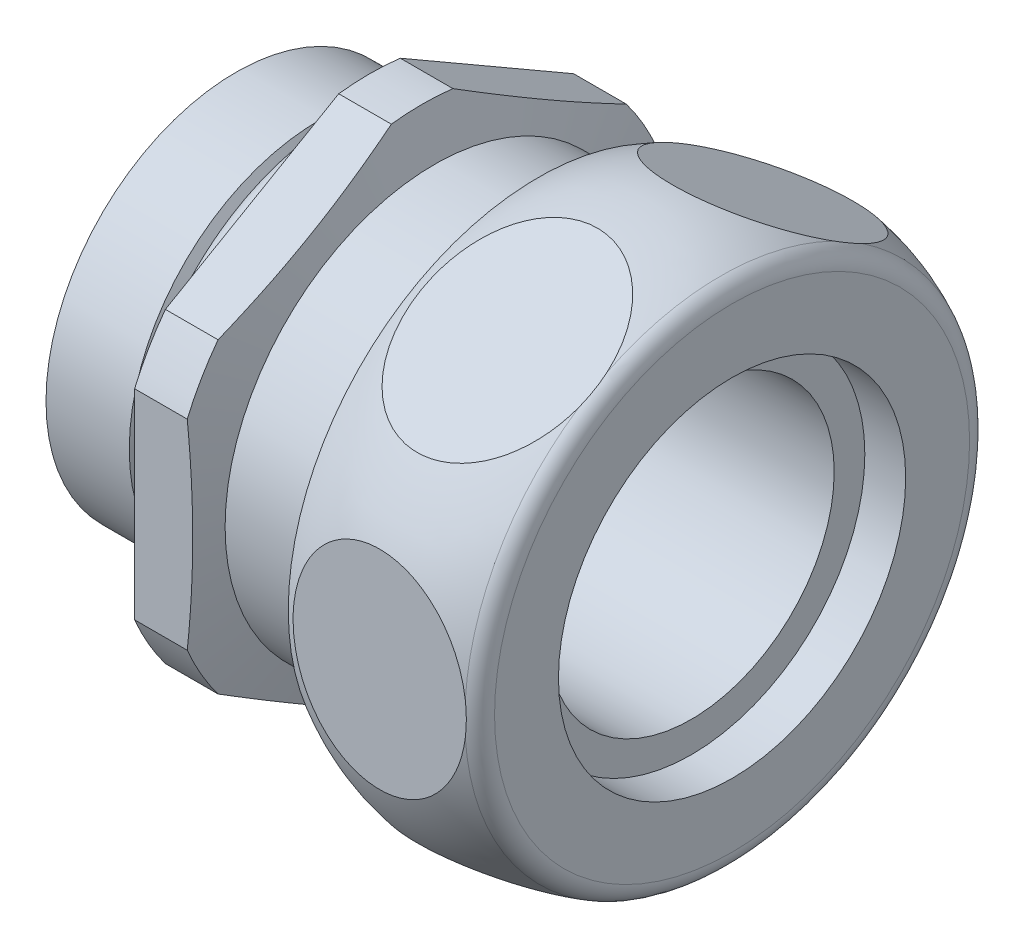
from build123d import *

# Parameters (mm, degrees)
SKIZZE2_R                       = 23
SCHNITT_LINEAR_AUSTRAGEN1_DEPTH = 3.16
SKIZZE3_R                       = 25
SCHNITT_LINEAR_AUSTRAGEN2_DEPTH = 9.5
SKIZZE4_R                       = 0.9
SKIZZE5_W                       = 7
SKIZZE5_H                       = 5.76
SCHNITT_LINEAR_START            = -2
SKIZZE6_R                       = 8.5
SKIZZE6_R_2                     = 6.5
SCHNITT_LINEAR_AUSTRAGEN3_DEPTH = 2
SKIZZE7_W                       = 30.407440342
SKIZZE7_H                       = 7


with BuildPart() as part:
    # Skizze1 → Rotation1 (revolve)
    with BuildSketch(Plane.XY, mode=Mode.PRIVATE) as rotation1_sk:
        with BuildLine():
            Line((-9.75, 5.75), (20.25, 5.75))
            Line((20.25, 5.75), (20.25, 6.5))
            Line((20.25, 6.5), (15, 6.5))
            Line((15, 6.5), (15, 11.628073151))
            ThreePointArc((15, 11.628073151), (14.848874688, 12.156667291), (14.441176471, 12.525493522))
            ThreePointArc((14.441176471, 12.525493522), (9.933283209, 13.494719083), (5.5, 12.227241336))
            Line((5.5, 12.227241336), (5.5, 10.25))
            Line((5.5, 10.25), (0.43, 10.25))
            Line((0.43, 10.25), (-0.172885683, 12.5))
            Line((-0.172885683, 12.5), (-2.75, 12.5))
            Line((-2.75, 12.5), (-2.75, 8.5))
            Line((-2.75, 8.5), (-4.75, 8.5))
            Line((-4.75, 8.5), (-5.211880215, 9.3))
            Line((-5.211880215, 9.3), (-9.288119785, 9.3))
            Line((-9.288119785, 9.3), (-9.75, 8.5))
            Line((-9.75, 8.5), (-9.75, 5.75))
        make_face()
    revolve(rotation1_sk.sketch.rotate(Axis((50, 0, 0), (-1, 0, 0)), 270), axis=Axis((50, 0, 0), (-1, 0, 0)))

    # Skizze2 → Schnitt-Linear austragen1 (cut)
    with BuildSketch(Plane(origin=(-2.75, 0, 0), x_dir=(0, 0, -1), z_dir=(1, 0, 0))):
        Circle(SKIZZE2_R)
        Polygon((-11.5, 6.639528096), (-11.5, -6.639528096), (0, -13.279056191), (11.5, -6.639528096), (11.5, 6.639528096), (0, 13.279056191), align=None, mode=Mode.SUBTRACT)
    extrude(amount=SCHNITT_LINEAR_AUSTRAGEN1_DEPTH, mode=Mode.SUBTRACT)

    # Skizze3 → Schnitt-Linear austragen2 (cut)
    with BuildSketch(Plane(origin=(15, 0, 0), x_dir=(0, 0, -1), z_dir=(1, 0, 0))):
        Circle(SKIZZE3_R)
        Polygon((-12.5, 7.216878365), (-12.5, -7.216878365), (0, -14.43375673), (12.5, -7.216878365), (12.5, 7.216878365), (0, 14.43375673), align=None, mode=Mode.SUBTRACT)
    extrude(amount=-SCHNITT_LINEAR_AUSTRAGEN2_DEPTH, mode=Mode.SUBTRACT)

    # Skizze4 → Rotation2 (revolve)
    with BuildSketch(Plane.XY, mode=Mode.PRIVATE) as rotation2_sk:
        with Locations((-3.45, 9.45)):
            Circle(SKIZZE4_R)
    revolve(rotation2_sk.sketch.rotate(Axis((50, 0, 0), (-1, 0, 0)), 270), axis=Axis((50, 0, 0), (-1, 0, 0)))

    # Skizze5 → Schnitt-Rotation1 (revolve, cut)
    with BuildSketch(Plane.XY, mode=Mode.PRIVATE) as schnitt_rotation1_sk:
        with Locations((-6.25, 2.88)):
            Rectangle(SKIZZE5_W, SKIZZE5_H)
    revolve(schnitt_rotation1_sk.sketch.rotate(Axis((-2.75, 0, 0), (-1, 0, 0)), 270), axis=Axis((-2.75, 0, 0), (-1, 0, 0)), mode=Mode.SUBTRACT)

    # Skizze6 → Schnitt-Linear austragen3 (cut)
    with BuildSketch(Plane(origin=(15, 0, 0), x_dir=(0, 0, -1), z_dir=(1, 0, 0)).offset(SCHNITT_LINEAR_START)):
        with Locations(Location((0, 0, 0), (0, 0, 180))):
            Circle(SKIZZE6_R)
        with Locations(Location((0, 0, 0), (0, 0, 180))):
            Circle(SKIZZE6_R_2, mode=Mode.SUBTRACT)
    extrude(amount=SCHNITT_LINEAR_AUSTRAGEN3_DEPTH, mode=Mode.SUBTRACT)

    # Skizze7 → Schnitt-Rotation2 (revolve, cut)
    with BuildSketch(Plane.XY, mode=Mode.PRIVATE) as schnitt_rotation2_sk:
        with Locations((5.453720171, 3.5)):
            Rectangle(SKIZZE7_W, SKIZZE7_H)
    revolve(schnitt_rotation2_sk.sketch.rotate(Axis((20.657440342, 0, 0), (-1, 0, 0)), 270), axis=Axis((20.657440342, 0, 0), (-1, 0, 0)), mode=Mode.SUBTRACT)


solid = part.part
